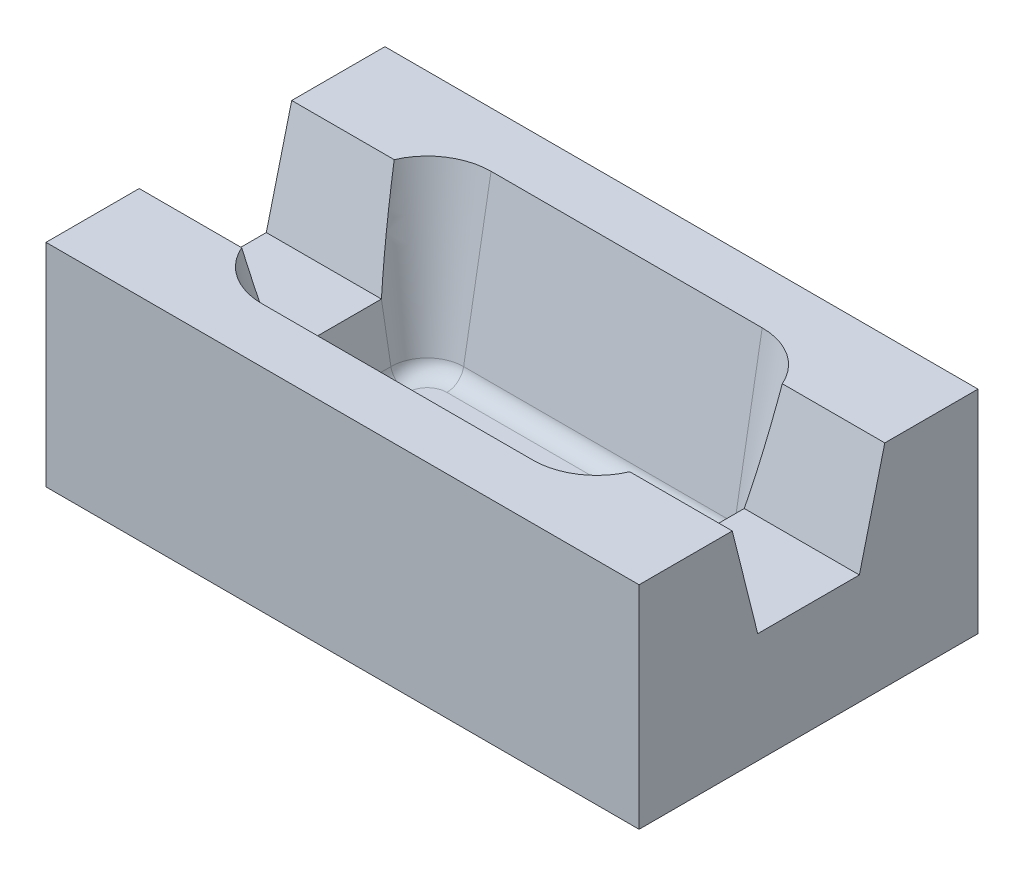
ISO-10303-21;
HEADER;
FILE_DESCRIPTION(('STEP AP214'),'2;1');
FILE_NAME('part.step','',(''),(''),'','','');
FILE_SCHEMA(('AUTOMOTIVE_DESIGN { 1 0 10303 214 1 1 1 1 }'));
ENDSEC;
DATA;
#1=APPLICATION_CONTEXT('core data for automotive mechanical design processes');
#2=APPLICATION_PROTOCOL_DEFINITION('international standard','automotive_design',2000,#1);
#3=PRODUCT_CONTEXT('',#1,'mechanical');
#4=PRODUCT('Part','Part','',(#3));
#5=PRODUCT_RELATED_PRODUCT_CATEGORY('part','',(#4));
#6=PRODUCT_DEFINITION_FORMATION('','',#4);
#7=PRODUCT_DEFINITION_CONTEXT('part definition',#1,'design');
#8=PRODUCT_DEFINITION('design','',#6,#7);
#9=PRODUCT_DEFINITION_SHAPE('','',#8);
#10=(LENGTH_UNIT() NAMED_UNIT(*) SI_UNIT(.MILLI.,.METRE.));
#11=(NAMED_UNIT(*) PLANE_ANGLE_UNIT() SI_UNIT($,.RADIAN.));
#12=(NAMED_UNIT(*) SI_UNIT($,.STERADIAN.) SOLID_ANGLE_UNIT());
#13=UNCERTAINTY_MEASURE_WITH_UNIT(LENGTH_MEASURE(1.E-05),#10,'distance_accuracy_value','');
#14=(GEOMETRIC_REPRESENTATION_CONTEXT(3) GLOBAL_UNCERTAINTY_ASSIGNED_CONTEXT((#13)) GLOBAL_UNIT_ASSIGNED_CONTEXT((#10,
#11,#12)) REPRESENTATION_CONTEXT('',''));
#15=CARTESIAN_POINT('',(0.,0.,0.));
#16=DIRECTION('',(0.,0.,1.));
#17=DIRECTION('',(1.,0.,0.));
#18=AXIS2_PLACEMENT_3D('',#15,#16,#17);
#19=CARTESIAN_POINT('',(-350.,-241.421515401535,59.9999999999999));
#20=DIRECTION('',(0.,0.242535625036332,-0.970142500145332));
#21=DIRECTION('',(0.,0.970142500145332,0.242535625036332));
#22=AXIS2_PLACEMENT_3D('',#19,#20,#21);
#23=PLANE('',#22);
#24=CARTESIAN_POINT('',(-160.,62.3270140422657,135.93713236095));
#25=DIRECTION('',(0.,0.242535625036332,-0.970142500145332));
#26=DIRECTION('',(0.,0.970142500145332,0.242535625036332));
#27=AXIS2_PLACEMENT_3D('',#24,#25,#26);
#28=ELLIPSE('',#27,443.915072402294,76.3239898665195);
#29=CARTESIAN_POINT('',(-214.106158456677,-241.421515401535,59.9999999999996));
#30=VERTEX_POINT('',#29);
#31=CARTESIAN_POINT('',(-229.028109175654,-121.421515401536,89.9999999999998));
#32=VERTEX_POINT('',#31);
#33=EDGE_CURVE('E300',#30,#32,#28,.T.);
#34=ORIENTED_EDGE('',*,*,#33,.F.);
#35=DIRECTION('',(1.,0.,0.));
#36=VECTOR('',#35,1.);
#37=CARTESIAN_POINT('',(-350.,-241.421515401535,59.9999999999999));
#38=LINE('',#37,#36);
#39=CARTESIAN_POINT('',(-350.,-241.421515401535,60.));
#40=VERTEX_POINT('',#39);
#41=EDGE_CURVE('E45',#40,#30,#38,.T.);
#42=ORIENTED_EDGE('',*,*,#41,.F.);
#43=DIRECTION('',(0.,-0.970142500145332,-0.242535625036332));
#44=VECTOR('',#43,1.);
#45=CARTESIAN_POINT('',(-350.,45.6373081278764,131.764705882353));
#46=LINE('',#45,#44);
#47=CARTESIAN_POINT('',(-350.,-121.421515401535,89.9999999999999));
#48=VERTEX_POINT('',#47);
#49=EDGE_CURVE('E205',#48,#40,#46,.T.);
#50=ORIENTED_EDGE('',*,*,#49,.F.);
#51=DIRECTION('',(1.,0.,0.));
#52=VECTOR('',#51,1.);
#53=CARTESIAN_POINT('',(-350.,-121.421515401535,89.9999999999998));
#54=LINE('',#53,#52);
#55=EDGE_CURVE('E211',#48,#32,#54,.T.);
#56=ORIENTED_EDGE('',*,*,#55,.T.);
#57=EDGE_LOOP('',(#34,#42,#50,#56));
#58=FACE_BOUND('',#57,.T.);
#59=ADVANCED_FACE('F36',(#58),#23,.T.);
#60=CARTESIAN_POINT('',(-350.,-121.421515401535,-90.));
#61=DIRECTION('',(0.,0.242535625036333,0.970142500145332));
#62=DIRECTION('',(0.,-0.970142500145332,0.242535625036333));
#63=AXIS2_PLACEMENT_3D('',#60,#61,#62);
#64=PLANE('',#63);
#65=CARTESIAN_POINT('',(-160.,62.3270140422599,-135.937132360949));
#66=DIRECTION('',(0.,0.242535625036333,0.970142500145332));
#67=DIRECTION('',(0.,0.970142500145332,-0.242535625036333));
#68=AXIS2_PLACEMENT_3D('',#65,#66,#67);
#69=ELLIPSE('',#68,443.915072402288,76.323989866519);
#70=CARTESIAN_POINT('',(-229.028109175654,-121.421515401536,-90.));
#71=VERTEX_POINT('',#70);
#72=CARTESIAN_POINT('',(-214.106158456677,-241.421515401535,-59.9999999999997));
#73=VERTEX_POINT('',#72);
#74=EDGE_CURVE('E210',#71,#73,#69,.T.);
#75=ORIENTED_EDGE('',*,*,#74,.F.);
#76=DIRECTION('',(-1.,0.,0.));
#77=VECTOR('',#76,1.);
#78=CARTESIAN_POINT('',(-160.,-121.421515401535,-90.));
#79=LINE('',#78,#77);
#80=CARTESIAN_POINT('',(-350.,-121.421515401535,-90.));
#81=VERTEX_POINT('',#80);
#82=EDGE_CURVE('E192',#71,#81,#79,.T.);
#83=ORIENTED_EDGE('',*,*,#82,.T.);
#84=DIRECTION('',(0.,0.970142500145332,-0.242535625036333));
#85=VECTOR('',#84,1.);
#86=CARTESIAN_POINT('',(-350.,-48.4803389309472,-108.235294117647));
#87=LINE('',#86,#85);
#88=CARTESIAN_POINT('',(-350.,-241.421515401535,-60.));
#89=VERTEX_POINT('',#88);
#90=EDGE_CURVE('E200',#89,#81,#87,.T.);
#91=ORIENTED_EDGE('',*,*,#90,.F.);
#92=DIRECTION('',(1.,0.,0.));
#93=VECTOR('',#92,1.);
#94=CARTESIAN_POINT('',(-350.,-241.421515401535,-60.));
#95=LINE('',#94,#93);
#96=EDGE_CURVE('E11',#89,#73,#95,.T.);
#97=ORIENTED_EDGE('',*,*,#96,.T.);
#98=EDGE_LOOP('',(#75,#83,#91,#97));
#99=FACE_BOUND('',#98,.T.);
#100=ADVANCED_FACE('F208',(#99),#64,.T.);
#101=CARTESIAN_POINT('',(-350.,-241.421515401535,-60.));
#102=DIRECTION('',(0.,1.,0.));
#103=DIRECTION('',(0.,0.,1.));
#104=AXIS2_PLACEMENT_3D('',#101,#102,#103);
#105=PLANE('',#104);
#106=DIRECTION('',(0.,0.,-1.));
#107=VECTOR('',#106,1.);
#108=CARTESIAN_POINT('',(-214.106158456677,-241.421515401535,-59.9999999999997));
#109=LINE('',#108,#107);
#110=EDGE_CURVE('E214',#73,#30,#109,.F.);
#111=ORIENTED_EDGE('',*,*,#110,.F.);
#112=ORIENTED_EDGE('',*,*,#96,.F.);
#113=DIRECTION('',(0.,0.,-1.));
#114=VECTOR('',#113,1.);
#115=CARTESIAN_POINT('',(-350.,-241.421515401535,200.));
#116=LINE('',#115,#114);
#117=EDGE_CURVE('E203',#40,#89,#116,.T.);
#118=ORIENTED_EDGE('',*,*,#117,.F.);
#119=ORIENTED_EDGE('',*,*,#41,.T.);
#120=EDGE_LOOP('',(#111,#112,#118,#119));
#121=FACE_BOUND('',#120,.T.);
#122=ADVANCED_FACE('F470',(#121),#105,.T.);
#123=CARTESIAN_POINT('',(183.218007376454,-301.421515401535,-59.9999999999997));
#124=DIRECTION('',(0.,0.,-1.));
#125=DIRECTION('',(-1.,0.,0.));
#126=AXIS2_PLACEMENT_3D('',#123,#124,#125);
#127=CYLINDRICAL_SURFACE('',#126,20.);
#128=CARTESIAN_POINT('',(183.218007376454,-301.421515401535,59.9999999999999));
#129=DIRECTION('',(0.,0.,-1.));
#130=DIRECTION('',(-1.,0.,0.));
#131=AXIS2_PLACEMENT_3D('',#128,#129,#130);
#132=CIRCLE('',#131,20.);
#133=CARTESIAN_POINT('',(202.914162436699,-304.894478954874,59.9999999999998));
#134=VERTEX_POINT('',#133);
#135=CARTESIAN_POINT('',(183.218007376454,-321.421515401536,59.9999999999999));
#136=VERTEX_POINT('',#135);
#137=EDGE_CURVE('E408',#134,#136,#132,.T.);
#138=ORIENTED_EDGE('',*,*,#137,.F.);
#139=DIRECTION('',(0.,0.,-1.));
#140=VECTOR('',#139,1.);
#141=CARTESIAN_POINT('',(202.914162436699,-304.894478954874,-59.9999999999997));
#142=LINE('',#141,#140);
#143=CARTESIAN_POINT('',(202.914162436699,-304.894478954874,-59.9999999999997));
#144=VERTEX_POINT('',#143);
#145=EDGE_CURVE('E402',#134,#144,#142,.T.);
#146=ORIENTED_EDGE('',*,*,#145,.T.);
#147=CARTESIAN_POINT('',(183.218007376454,-301.421515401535,-59.9999999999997));
#148=DIRECTION('',(0.,0.,-1.));
#149=DIRECTION('',(-1.,0.,0.));
#150=AXIS2_PLACEMENT_3D('',#147,#148,#149);
#151=CIRCLE('',#150,20.);
#152=CARTESIAN_POINT('',(183.218007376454,-321.421515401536,-59.9999999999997));
#153=VERTEX_POINT('',#152);
#154=EDGE_CURVE('E400',#144,#153,#151,.T.);
#155=ORIENTED_EDGE('',*,*,#154,.T.);
#156=DIRECTION('',(0.,0.,1.));
#157=VECTOR('',#156,1.);
#158=CARTESIAN_POINT('',(183.218007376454,-321.421515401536,59.9999999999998));
#159=LINE('',#158,#157);
#160=EDGE_CURVE('E397',#153,#136,#159,.T.);
#161=ORIENTED_EDGE('',*,*,#160,.T.);
#162=EDGE_LOOP('',(#138,#146,#155,#161));
#163=FACE_BOUND('',#162,.T.);
#164=ADVANCED_FACE('F446',(#163),#127,.F.);
#165=CARTESIAN_POINT('',(160.,-321.421515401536,-60.));
#166=DIRECTION('',(0.,-1.,0.));
#167=DIRECTION('',(0.,0.,-1.));
#168=AXIS2_PLACEMENT_3D('',#165,#166,#167);
#169=PLANE('',#168);
#170=CARTESIAN_POINT('',(-160.,-321.421515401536,-60.));
#171=DIRECTION('',(0.,-1.,0.));
#172=DIRECTION('',(0.,0.,-1.));
#173=AXIS2_PLACEMENT_3D('',#170,#171,#172);
#174=CIRCLE('',#173,23.2180073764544);
#175=CARTESIAN_POINT('',(-183.218007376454,-321.421515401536,-59.9999999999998));
#176=VERTEX_POINT('',#175);
#177=CARTESIAN_POINT('',(-160.,-321.421515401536,-83.2180073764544));
#178=VERTEX_POINT('',#177);
#179=EDGE_CURVE('E262',#176,#178,#174,.T.);
#180=ORIENTED_EDGE('',*,*,#179,.F.);
#181=DIRECTION('',(0.,0.,-1.));
#182=VECTOR('',#181,1.);
#183=CARTESIAN_POINT('',(-183.218007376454,-321.421515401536,-59.9999999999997));
#184=LINE('',#183,#182);
#185=CARTESIAN_POINT('',(-183.218007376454,-321.421515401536,59.9999999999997));
#186=VERTEX_POINT('',#185);
#187=EDGE_CURVE('E271',#186,#176,#184,.T.);
#188=ORIENTED_EDGE('',*,*,#187,.F.);
#189=CARTESIAN_POINT('',(-160.,-321.421515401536,60.));
#190=DIRECTION('',(0.,-1.,0.));
#191=DIRECTION('',(0.,0.,-1.));
#192=AXIS2_PLACEMENT_3D('',#189,#190,#191);
#193=CIRCLE('',#192,23.2180073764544);
#194=CARTESIAN_POINT('',(-160.,-321.421515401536,83.2180073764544));
#195=VERTEX_POINT('',#194);
#196=EDGE_CURVE('E236',#195,#186,#193,.T.);
#197=ORIENTED_EDGE('',*,*,#196,.F.);
#198=DIRECTION('',(-1.,0.,0.));
#199=VECTOR('',#198,1.);
#200=CARTESIAN_POINT('',(-160.,-321.421515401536,83.2180073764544));
#201=LINE('',#200,#199);
#202=CARTESIAN_POINT('',(160.,-321.421515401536,83.2180073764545));
#203=VERTEX_POINT('',#202);
#204=EDGE_CURVE('E413',#203,#195,#201,.T.);
#205=ORIENTED_EDGE('',*,*,#204,.F.);
#206=CARTESIAN_POINT('',(160.,-321.421515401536,60.));
#207=DIRECTION('',(0.,-1.,0.));
#208=DIRECTION('',(0.,0.,-1.));
#209=AXIS2_PLACEMENT_3D('',#206,#207,#208);
#210=CIRCLE('',#209,23.2180073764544);
#211=EDGE_CURVE('E405',#136,#203,#210,.T.);
#212=ORIENTED_EDGE('',*,*,#211,.F.);
#213=ORIENTED_EDGE('',*,*,#160,.F.);
#214=CARTESIAN_POINT('',(160.,-321.421515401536,-60.));
#215=DIRECTION('',(0.,-1.,0.));
#216=DIRECTION('',(0.,0.,-1.));
#217=AXIS2_PLACEMENT_3D('',#214,#215,#216);
#218=CIRCLE('',#217,23.2180073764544);
#219=CARTESIAN_POINT('',(160.,-321.421515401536,-83.2180073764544));
#220=VERTEX_POINT('',#219);
#221=EDGE_CURVE('E350',#220,#153,#218,.T.);
#222=ORIENTED_EDGE('',*,*,#221,.F.);
#223=DIRECTION('',(1.,0.,0.));
#224=VECTOR('',#223,1.);
#225=CARTESIAN_POINT('',(160.,-321.421515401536,-83.2180073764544));
#226=LINE('',#225,#224);
#227=EDGE_CURVE('E250',#178,#220,#226,.T.);
#228=ORIENTED_EDGE('',*,*,#227,.F.);
#229=EDGE_LOOP('',(#180,#188,#197,#205,#212,#213,#222,#228));
#230=FACE_BOUND('',#229,.T.);
#231=ADVANCED_FACE('F441',(#230),#169,.F.);
#232=CARTESIAN_POINT('',(-160.,-301.421515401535,83.2180073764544));
#233=DIRECTION('',(1.,0.,0.));
#234=DIRECTION('',(0.,0.,-1.));
#235=AXIS2_PLACEMENT_3D('',#232,#233,#234);
#236=CYLINDRICAL_SURFACE('',#235,20.);
#237=CARTESIAN_POINT('',(-160.,-301.421515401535,83.2180073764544));
#238=DIRECTION('',(-1.,0.,0.));
#239=DIRECTION('',(0.,0.,1.));
#240=AXIS2_PLACEMENT_3D('',#237,#238,#239);
#241=CIRCLE('',#240,20.);
#242=CARTESIAN_POINT('',(-160.,-304.894478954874,102.914162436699));
#243=VERTEX_POINT('',#242);
#244=EDGE_CURVE('E316',#195,#243,#241,.T.);
#245=ORIENTED_EDGE('',*,*,#244,.T.);
#246=DIRECTION('',(1.,0.,0.));
#247=VECTOR('',#246,1.);
#248=CARTESIAN_POINT('',(160.,-304.894478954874,102.914162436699));
#249=LINE('',#248,#247);
#250=CARTESIAN_POINT('',(160.,-304.894478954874,102.914162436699));
#251=VERTEX_POINT('',#250);
#252=EDGE_CURVE('E418',#243,#251,#249,.T.);
#253=ORIENTED_EDGE('',*,*,#252,.T.);
#254=CARTESIAN_POINT('',(160.,-301.421515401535,83.2180073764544));
#255=DIRECTION('',(1.,0.,0.));
#256=DIRECTION('',(0.,0.,-1.));
#257=AXIS2_PLACEMENT_3D('',#254,#255,#256);
#258=CIRCLE('',#257,20.);
#259=EDGE_CURVE('E416',#251,#203,#258,.T.);
#260=ORIENTED_EDGE('',*,*,#259,.T.);
#261=ORIENTED_EDGE('',*,*,#204,.T.);
#262=EDGE_LOOP('',(#245,#253,#260,#261));
#263=FACE_BOUND('',#262,.T.);
#264=ADVANCED_FACE('F423',(#263),#236,.F.);
#265=CARTESIAN_POINT('',(160.,-301.421515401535,60.));
#266=DIRECTION('',(0.,-1.,0.));
#267=DIRECTION('',(0.,0.,-1.));
#268=AXIS2_PLACEMENT_3D('',#265,#266,#267);
#269=TOROIDAL_SURFACE('',#268,23.2180073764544,20.);
#270=ORIENTED_EDGE('',*,*,#259,.F.);
#271=CARTESIAN_POINT('',(160.,-304.894478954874,60.));
#272=DIRECTION('',(0.,1.,0.));
#273=DIRECTION('',(0.,0.,1.));
#274=AXIS2_PLACEMENT_3D('',#271,#272,#273);
#275=CIRCLE('',#274,42.9141624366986);
#276=EDGE_CURVE('E410',#251,#134,#275,.T.);
#277=ORIENTED_EDGE('',*,*,#276,.T.);
#278=ORIENTED_EDGE('',*,*,#137,.T.);
#279=ORIENTED_EDGE('',*,*,#211,.T.);
#280=EDGE_LOOP('',(#270,#277,#278,#279));
#281=FACE_BOUND('',#280,.T.);
#282=ADVANCED_FACE('F436',(#281),#269,.F.);
#283=CARTESIAN_POINT('',(350.,-241.421515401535,-59.9999999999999));
#284=DIRECTION('',(0.,1.,0.));
#285=DIRECTION('',(0.,0.,1.));
#286=AXIS2_PLACEMENT_3D('',#283,#284,#285);
#287=PLANE('',#286);
#288=DIRECTION('',(0.,0.,1.));
#289=VECTOR('',#288,1.);
#290=CARTESIAN_POINT('',(350.,-241.421515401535,200.));
#291=LINE('',#290,#289);
#292=CARTESIAN_POINT('',(350.,-241.421515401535,-60.0000000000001));
#293=VERTEX_POINT('',#292);
#294=CARTESIAN_POINT('',(350.,-241.421515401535,60.));
#295=VERTEX_POINT('',#294);
#296=EDGE_CURVE('E367',#293,#295,#291,.T.);
#297=ORIENTED_EDGE('',*,*,#296,.F.);
#298=DIRECTION('',(-1.,0.,0.));
#299=VECTOR('',#298,1.);
#300=CARTESIAN_POINT('',(350.,-241.421515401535,-59.9999999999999));
#301=LINE('',#300,#299);
#302=CARTESIAN_POINT('',(214.106158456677,-241.421515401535,-59.9999999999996));
#303=VERTEX_POINT('',#302);
#304=EDGE_CURVE('E293',#293,#303,#301,.T.);
#305=ORIENTED_EDGE('',*,*,#304,.T.);
#306=DIRECTION('',(0.,0.,1.));
#307=VECTOR('',#306,1.);
#308=CARTESIAN_POINT('',(214.106158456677,-241.421515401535,-59.9999999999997));
#309=LINE('',#308,#307);
#310=CARTESIAN_POINT('',(214.106158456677,-241.421515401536,59.9999999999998));
#311=VERTEX_POINT('',#310);
#312=EDGE_CURVE('E360',#311,#303,#309,.F.);
#313=ORIENTED_EDGE('',*,*,#312,.F.);
#314=DIRECTION('',(-1.,0.,0.));
#315=VECTOR('',#314,1.);
#316=CARTESIAN_POINT('',(350.,-241.421515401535,60.));
#317=LINE('',#316,#315);
#318=EDGE_CURVE('E297',#295,#311,#317,.T.);
#319=ORIENTED_EDGE('',*,*,#318,.F.);
#320=EDGE_LOOP('',(#297,#305,#313,#319));
#321=FACE_BOUND('',#320,.T.);
#322=ADVANCED_FACE('F505',(#321),#287,.T.);
#323=CARTESIAN_POINT('',(160.,-301.421515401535,-60.));
#324=DIRECTION('',(0.,-1.,0.));
#325=DIRECTION('',(0.,0.,-1.));
#326=AXIS2_PLACEMENT_3D('',#323,#324,#325);
#327=TOROIDAL_SURFACE('',#326,23.2180073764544,20.);
#328=ORIENTED_EDGE('',*,*,#154,.F.);
#329=CARTESIAN_POINT('',(160.,-304.894478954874,-60.));
#330=DIRECTION('',(0.,1.,0.));
#331=DIRECTION('',(0.,0.,1.));
#332=AXIS2_PLACEMENT_3D('',#329,#330,#331);
#333=CIRCLE('',#332,42.9141624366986);
#334=CARTESIAN_POINT('',(160.,-304.894478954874,-102.914162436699));
#335=VERTEX_POINT('',#334);
#336=EDGE_CURVE('E395',#144,#335,#333,.T.);
#337=ORIENTED_EDGE('',*,*,#336,.T.);
#338=CARTESIAN_POINT('',(160.,-301.421515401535,-83.2180073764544));
#339=DIRECTION('',(-1.,0.,0.));
#340=DIRECTION('',(0.,-1.,0.));
#341=AXIS2_PLACEMENT_3D('',#338,#339,#340);
#342=CIRCLE('',#341,20.);
#343=EDGE_CURVE('E336',#335,#220,#342,.T.);
#344=ORIENTED_EDGE('',*,*,#343,.T.);
#345=ORIENTED_EDGE('',*,*,#221,.T.);
#346=EDGE_LOOP('',(#328,#337,#344,#345));
#347=FACE_BOUND('',#346,.T.);
#348=ADVANCED_FACE('F444',(#347),#327,.F.);
#349=CARTESIAN_POINT('',(200.,-321.421515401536,-59.9999999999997));
#350=DIRECTION('',(0.984807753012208,-0.173648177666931,0.));
#351=DIRECTION('',(0.173648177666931,0.984807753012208,0.));
#352=AXIS2_PLACEMENT_3D('',#349,#350,#351);
#353=PLANE('',#352);
#354=DIRECTION('',(0.173648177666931,0.984807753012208,0.));
#355=VECTOR('',#354,1.);
#356=CARTESIAN_POINT('',(200.,-321.421515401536,59.9999999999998));
#357=LINE('',#356,#355);
#358=EDGE_CURVE('E433',#311,#134,#357,.F.);
#359=ORIENTED_EDGE('',*,*,#358,.F.);
#360=ORIENTED_EDGE('',*,*,#312,.T.);
#361=DIRECTION('',(0.173648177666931,0.984807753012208,0.));
#362=VECTOR('',#361,1.);
#363=CARTESIAN_POINT('',(200.,-321.421515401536,-59.9999999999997));
#364=LINE('',#363,#362);
#365=EDGE_CURVE('E357',#303,#144,#364,.F.);
#366=ORIENTED_EDGE('',*,*,#365,.T.);
#367=ORIENTED_EDGE('',*,*,#145,.F.);
#368=EDGE_LOOP('',(#359,#360,#366,#367));
#369=FACE_BOUND('',#368,.T.);
#370=ADVANCED_FACE('F448',(#369),#353,.F.);
#371=CARTESIAN_POINT('',(-160.,-301.421515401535,-83.2180073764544));
#372=DIRECTION('',(-1.,0.,0.));
#373=DIRECTION('',(0.,0.,1.));
#374=AXIS2_PLACEMENT_3D('',#371,#372,#373);
#375=CYLINDRICAL_SURFACE('',#374,20.);
#376=ORIENTED_EDGE('',*,*,#343,.F.);
#377=DIRECTION('',(-1.,0.,0.));
#378=VECTOR('',#377,1.);
#379=CARTESIAN_POINT('',(-160.,-304.894478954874,-102.914162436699));
#380=LINE('',#379,#378);
#381=CARTESIAN_POINT('',(-160.,-304.894478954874,-102.914162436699));
#382=VERTEX_POINT('',#381);
#383=EDGE_CURVE('E253',#335,#382,#380,.T.);
#384=ORIENTED_EDGE('',*,*,#383,.T.);
#385=CARTESIAN_POINT('',(-160.,-301.421515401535,-83.2180073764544));
#386=DIRECTION('',(1.,0.,0.));
#387=DIRECTION('',(0.,0.,-1.));
#388=AXIS2_PLACEMENT_3D('',#385,#386,#387);
#389=CIRCLE('',#388,20.);
#390=EDGE_CURVE('E259',#178,#382,#389,.T.);
#391=ORIENTED_EDGE('',*,*,#390,.F.);
#392=ORIENTED_EDGE('',*,*,#227,.T.);
#393=EDGE_LOOP('',(#376,#384,#391,#392));
#394=FACE_BOUND('',#393,.T.);
#395=ADVANCED_FACE('F334',(#394),#375,.F.);
#396=CARTESIAN_POINT('',(-183.218007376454,-301.421515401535,-59.9999999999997));
#397=DIRECTION('',(0.,0.,1.));
#398=DIRECTION('',(1.,0.,0.));
#399=AXIS2_PLACEMENT_3D('',#396,#397,#398);
#400=CYLINDRICAL_SURFACE('',#399,20.);
#401=CARTESIAN_POINT('',(-183.218007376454,-301.421515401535,59.9999999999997));
#402=DIRECTION('',(0.,0.,-1.));
#403=DIRECTION('',(-1.,0.,0.));
#404=AXIS2_PLACEMENT_3D('',#401,#402,#403);
#405=CIRCLE('',#404,20.);
#406=CARTESIAN_POINT('',(-202.914162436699,-304.894478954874,59.9999999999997));
#407=VERTEX_POINT('',#406);
#408=EDGE_CURVE('E241',#186,#407,#405,.T.);
#409=ORIENTED_EDGE('',*,*,#408,.F.);
#410=ORIENTED_EDGE('',*,*,#187,.T.);
#411=CARTESIAN_POINT('',(-183.218007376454,-301.421515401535,-59.9999999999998));
#412=DIRECTION('',(0.,0.,-1.));
#413=DIRECTION('',(-1.,0.,0.));
#414=AXIS2_PLACEMENT_3D('',#411,#412,#413);
#415=CIRCLE('',#414,20.);
#416=CARTESIAN_POINT('',(-202.914162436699,-304.894478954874,-59.9999999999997));
#417=VERTEX_POINT('',#416);
#418=EDGE_CURVE('E268',#176,#417,#415,.T.);
#419=ORIENTED_EDGE('',*,*,#418,.T.);
#420=DIRECTION('',(0.,0.,1.));
#421=VECTOR('',#420,1.);
#422=CARTESIAN_POINT('',(-202.914162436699,-304.894478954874,59.9999999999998));
#423=LINE('',#422,#421);
#424=EDGE_CURVE('E265',#417,#407,#423,.T.);
#425=ORIENTED_EDGE('',*,*,#424,.T.);
#426=EDGE_LOOP('',(#409,#410,#419,#425));
#427=FACE_BOUND('',#426,.T.);
#428=ADVANCED_FACE('F322',(#427),#400,.F.);
#429=CARTESIAN_POINT('',(-160.,-301.421515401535,-60.));
#430=DIRECTION('',(0.,-1.,0.));
#431=DIRECTION('',(0.,0.,-1.));
#432=AXIS2_PLACEMENT_3D('',#429,#430,#431);
#433=TOROIDAL_SURFACE('',#432,23.2180073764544,20.);
#434=ORIENTED_EDGE('',*,*,#418,.F.);
#435=ORIENTED_EDGE('',*,*,#179,.T.);
#436=ORIENTED_EDGE('',*,*,#390,.T.);
#437=CARTESIAN_POINT('',(-160.,-304.894478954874,-60.));
#438=DIRECTION('',(0.,1.,0.));
#439=DIRECTION('',(0.,0.,1.));
#440=AXIS2_PLACEMENT_3D('',#437,#438,#439);
#441=CIRCLE('',#440,42.9141624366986);
#442=EDGE_CURVE('E256',#382,#417,#441,.T.);
#443=ORIENTED_EDGE('',*,*,#442,.T.);
#444=EDGE_LOOP('',(#434,#435,#436,#443));
#445=FACE_BOUND('',#444,.T.);
#446=ADVANCED_FACE('F326',(#445),#433,.F.);
#447=CARTESIAN_POINT('',(-160.,-301.421515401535,60.));
#448=DIRECTION('',(0.,-1.,0.));
#449=DIRECTION('',(0.,0.,-1.));
#450=AXIS2_PLACEMENT_3D('',#447,#448,#449);
#451=TOROIDAL_SURFACE('',#450,23.2180073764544,20.);
#452=ORIENTED_EDGE('',*,*,#244,.F.);
#453=ORIENTED_EDGE('',*,*,#196,.T.);
#454=ORIENTED_EDGE('',*,*,#408,.T.);
#455=CARTESIAN_POINT('',(-160.,-304.894478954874,60.));
#456=DIRECTION('',(0.,1.,0.));
#457=DIRECTION('',(0.,0.,1.));
#458=AXIS2_PLACEMENT_3D('',#455,#456,#457);
#459=CIRCLE('',#458,42.9141624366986);
#460=EDGE_CURVE('E313',#407,#243,#459,.T.);
#461=ORIENTED_EDGE('',*,*,#460,.T.);
#462=EDGE_LOOP('',(#452,#453,#454,#461));
#463=FACE_BOUND('',#462,.T.);
#464=ADVANCED_FACE('F318',(#463),#451,.F.);
#465=CARTESIAN_POINT('',(-200.,-321.421515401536,-59.9999999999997));
#466=DIRECTION('',(-0.984807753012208,-0.173648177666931,0.));
#467=DIRECTION('',(0.173648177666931,-0.984807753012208,0.));
#468=AXIS2_PLACEMENT_3D('',#465,#466,#467);
#469=PLANE('',#468);
#470=DIRECTION('',(-0.173648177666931,0.984807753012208,0.));
#471=VECTOR('',#470,1.);
#472=CARTESIAN_POINT('',(-200.,-321.421515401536,-59.9999999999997));
#473=LINE('',#472,#471);
#474=EDGE_CURVE('E218',#73,#417,#473,.F.);
#475=ORIENTED_EDGE('',*,*,#474,.F.);
#476=ORIENTED_EDGE('',*,*,#110,.T.);
#477=DIRECTION('',(-0.173648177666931,0.984807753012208,0.));
#478=VECTOR('',#477,1.);
#479=CARTESIAN_POINT('',(-200.,-321.421515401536,59.9999999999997));
#480=LINE('',#479,#478);
#481=EDGE_CURVE('E224',#30,#407,#480,.F.);
#482=ORIENTED_EDGE('',*,*,#481,.T.);
#483=ORIENTED_EDGE('',*,*,#424,.F.);
#484=EDGE_LOOP('',(#475,#476,#482,#483));
#485=FACE_BOUND('',#484,.T.);
#486=ADVANCED_FACE('F307',(#485),#469,.F.);
#487=CARTESIAN_POINT('',(0.,-371.421515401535,0.));
#488=DIRECTION('',(0.,-1.,0.));
#489=DIRECTION('',(0.,0.,-1.));
#490=AXIS2_PLACEMENT_3D('',#487,#488,#489);
#491=PLANE('',#490);
#492=DIRECTION('',(0.,0.,1.));
#493=VECTOR('',#492,1.);
#494=CARTESIAN_POINT('',(350.,-371.421515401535,200.));
#495=LINE('',#494,#493);
#496=CARTESIAN_POINT('',(350.,-371.421515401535,-200.));
#497=VERTEX_POINT('',#496);
#498=CARTESIAN_POINT('',(350.,-371.421515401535,200.));
#499=VERTEX_POINT('',#498);
#500=EDGE_CURVE('E292',#497,#499,#495,.T.);
#501=ORIENTED_EDGE('',*,*,#500,.T.);
#502=DIRECTION('',(-1.,0.,0.));
#503=VECTOR('',#502,1.);
#504=CARTESIAN_POINT('',(-350.,-371.421515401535,200.));
#505=LINE('',#504,#503);
#506=CARTESIAN_POINT('',(-350.,-371.421515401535,200.));
#507=VERTEX_POINT('',#506);
#508=EDGE_CURVE('E386',#499,#507,#505,.T.);
#509=ORIENTED_EDGE('',*,*,#508,.T.);
#510=DIRECTION('',(0.,0.,-1.));
#511=VECTOR('',#510,1.);
#512=CARTESIAN_POINT('',(-350.,-371.421515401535,200.));
#513=LINE('',#512,#511);
#514=CARTESIAN_POINT('',(-350.,-371.421515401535,-200.));
#515=VERTEX_POINT('',#514);
#516=EDGE_CURVE('E383',#507,#515,#513,.T.);
#517=ORIENTED_EDGE('',*,*,#516,.T.);
#518=DIRECTION('',(1.,0.,0.));
#519=VECTOR('',#518,1.);
#520=CARTESIAN_POINT('',(-350.,-371.421515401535,-200.));
#521=LINE('',#520,#519);
#522=EDGE_CURVE('E280',#515,#497,#521,.T.);
#523=ORIENTED_EDGE('',*,*,#522,.T.);
#524=EDGE_LOOP('',(#501,#509,#517,#523));
#525=FACE_BOUND('',#524,.T.);
#526=ADVANCED_FACE('F460',(#525),#491,.T.);
#527=CARTESIAN_POINT('',(-160.,-321.421515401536,60.));
#528=DIRECTION('',(0.,1.,0.));
#529=DIRECTION('',(0.,0.,1.));
#530=AXIS2_PLACEMENT_3D('',#527,#528,#529);
#531=CONICAL_SURFACE('',#530,40.,0.174532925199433);
#532=ORIENTED_EDGE('',*,*,#481,.F.);
#533=ORIENTED_EDGE('',*,*,#33,.T.);
#534=CARTESIAN_POINT('',(-160.,-121.421515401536,60.));
#535=DIRECTION('',(0.,1.,0.));
#536=DIRECTION('',(0.,0.,1.));
#537=AXIS2_PLACEMENT_3D('',#534,#535,#536);
#538=CIRCLE('',#537,75.2653961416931);
#539=CARTESIAN_POINT('',(-160.,-121.421515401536,135.265396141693));
#540=VERTEX_POINT('',#539);
#541=EDGE_CURVE('E225',#32,#540,#538,.T.);
#542=ORIENTED_EDGE('',*,*,#541,.T.);
#543=DIRECTION('',(0.,0.984807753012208,0.173648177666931));
#544=VECTOR('',#543,1.);
#545=CARTESIAN_POINT('',(-160.,-321.421515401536,100.));
#546=LINE('',#545,#544);
#547=EDGE_CURVE('E227',#540,#243,#546,.F.);
#548=ORIENTED_EDGE('',*,*,#547,.T.);
#549=ORIENTED_EDGE('',*,*,#460,.F.);
#550=EDGE_LOOP('',(#532,#533,#542,#548,#549));
#551=FACE_BOUND('',#550,.T.);
#552=ADVANCED_FACE('F310',(#551),#531,.F.);
#553=CARTESIAN_POINT('',(-160.,-321.421515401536,100.));
#554=DIRECTION('',(0.,-0.173648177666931,0.984807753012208));
#555=DIRECTION('',(0.,-0.984807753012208,-0.173648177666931));
#556=AXIS2_PLACEMENT_3D('',#553,#554,#555);
#557=PLANE('',#556);
#558=ORIENTED_EDGE('',*,*,#547,.F.);
#559=DIRECTION('',(-1.,0.,0.));
#560=VECTOR('',#559,1.);
#561=CARTESIAN_POINT('',(160.,-121.421515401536,135.265396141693));
#562=LINE('',#561,#560);
#563=CARTESIAN_POINT('',(160.,-121.421515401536,135.265396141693));
#564=VERTEX_POINT('',#563);
#565=EDGE_CURVE('E276',#540,#564,#562,.F.);
#566=ORIENTED_EDGE('',*,*,#565,.T.);
#567=DIRECTION('',(0.,0.984807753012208,0.173648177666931));
#568=VECTOR('',#567,1.);
#569=CARTESIAN_POINT('',(160.,-321.421515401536,100.));
#570=LINE('',#569,#568);
#571=EDGE_CURVE('E274',#564,#251,#570,.F.);
#572=ORIENTED_EDGE('',*,*,#571,.T.);
#573=ORIENTED_EDGE('',*,*,#252,.F.);
#574=EDGE_LOOP('',(#558,#566,#572,#573));
#575=FACE_BOUND('',#574,.T.);
#576=ADVANCED_FACE('F426',(#575),#557,.F.);
#577=CARTESIAN_POINT('',(160.,-321.421515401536,60.));
#578=DIRECTION('',(0.,1.,0.));
#579=DIRECTION('',(0.,0.,1.));
#580=AXIS2_PLACEMENT_3D('',#577,#578,#579);
#581=CONICAL_SURFACE('',#580,40.,0.174532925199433);
#582=CARTESIAN_POINT('',(160.,-121.421515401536,60.));
#583=DIRECTION('',(0.,1.,0.));
#584=DIRECTION('',(0.,0.,1.));
#585=AXIS2_PLACEMENT_3D('',#582,#583,#584);
#586=CIRCLE('',#585,75.2653961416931);
#587=CARTESIAN_POINT('',(229.028109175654,-121.421515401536,89.9999999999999));
#588=VERTEX_POINT('',#587);
#589=EDGE_CURVE('E284',#564,#588,#586,.T.);
#590=ORIENTED_EDGE('',*,*,#589,.T.);
#591=CARTESIAN_POINT('',(160.,62.3270140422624,135.937132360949));
#592=DIRECTION('',(0.,0.242535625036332,-0.970142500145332));
#593=DIRECTION('',(0.,0.970142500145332,0.242535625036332));
#594=AXIS2_PLACEMENT_3D('',#591,#592,#593);
#595=ELLIPSE('',#594,443.915072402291,76.3239898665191);
#596=EDGE_CURVE('E376',#588,#311,#595,.T.);
#597=ORIENTED_EDGE('',*,*,#596,.T.);
#598=ORIENTED_EDGE('',*,*,#358,.T.);
#599=ORIENTED_EDGE('',*,*,#276,.F.);
#600=ORIENTED_EDGE('',*,*,#571,.F.);
#601=EDGE_LOOP('',(#590,#597,#598,#599,#600));
#602=FACE_BOUND('',#601,.T.);
#603=ADVANCED_FACE('F431',(#602),#581,.F.);
#604=CARTESIAN_POINT('',(350.,-121.421515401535,89.9999999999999));
#605=DIRECTION('',(0.,0.242535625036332,-0.970142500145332));
#606=DIRECTION('',(0.,0.970142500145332,0.242535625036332));
#607=AXIS2_PLACEMENT_3D('',#604,#605,#606);
#608=PLANE('',#607);
#609=DIRECTION('',(0.,0.970142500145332,0.242535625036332));
#610=VECTOR('',#609,1.);
#611=CARTESIAN_POINT('',(350.,45.6373081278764,131.764705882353));
#612=LINE('',#611,#610);
#613=CARTESIAN_POINT('',(350.,-121.421515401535,89.9999999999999));
#614=VERTEX_POINT('',#613);
#615=EDGE_CURVE('E359',#295,#614,#612,.T.);
#616=ORIENTED_EDGE('',*,*,#615,.F.);
#617=ORIENTED_EDGE('',*,*,#318,.T.);
#618=ORIENTED_EDGE('',*,*,#596,.F.);
#619=DIRECTION('',(1.,0.,0.));
#620=VECTOR('',#619,1.);
#621=CARTESIAN_POINT('',(-160.,-121.421515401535,89.9999999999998));
#622=LINE('',#621,#620);
#623=EDGE_CURVE('E296',#588,#614,#622,.T.);
#624=ORIENTED_EDGE('',*,*,#623,.T.);
#625=EDGE_LOOP('',(#616,#617,#618,#624));
#626=FACE_BOUND('',#625,.T.);
#627=ADVANCED_FACE('F655',(#626),#608,.T.);
#628=CARTESIAN_POINT('',(-350.,28.5784845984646,200.));
#629=DIRECTION('',(0.,0.,1.));
#630=DIRECTION('',(1.,0.,0.));
#631=AXIS2_PLACEMENT_3D('',#628,#629,#630);
#632=PLANE('',#631);
#633=DIRECTION('',(1.,0.,0.));
#634=VECTOR('',#633,1.);
#635=CARTESIAN_POINT('',(-350.,-121.421515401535,200.));
#636=LINE('',#635,#634);
#637=CARTESIAN_POINT('',(-350.,-121.421515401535,200.));
#638=VERTEX_POINT('',#637);
#639=CARTESIAN_POINT('',(350.,-121.421515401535,200.));
#640=VERTEX_POINT('',#639);
#641=EDGE_CURVE('E282',#638,#640,#636,.T.);
#642=ORIENTED_EDGE('',*,*,#641,.F.);
#643=DIRECTION('',(0.,-1.,0.));
#644=VECTOR('',#643,1.);
#645=CARTESIAN_POINT('',(-350.,28.5784845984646,200.));
#646=LINE('',#645,#644);
#647=EDGE_CURVE('E290',#638,#507,#646,.T.);
#648=ORIENTED_EDGE('',*,*,#647,.T.);
#649=ORIENTED_EDGE('',*,*,#508,.F.);
#650=DIRECTION('',(0.,-1.,0.));
#651=VECTOR('',#650,1.);
#652=CARTESIAN_POINT('',(350.,28.5784845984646,200.));
#653=LINE('',#652,#651);
#654=EDGE_CURVE('E288',#640,#499,#653,.T.);
#655=ORIENTED_EDGE('',*,*,#654,.F.);
#656=EDGE_LOOP('',(#642,#648,#649,#655));
#657=FACE_BOUND('',#656,.T.);
#658=ADVANCED_FACE('F466',(#657),#632,.T.);
#659=CARTESIAN_POINT('',(-350.,28.5784845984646,200.));
#660=DIRECTION('',(-1.,0.,0.));
#661=DIRECTION('',(0.,0.,1.));
#662=AXIS2_PLACEMENT_3D('',#659,#660,#661);
#663=PLANE('',#662);
#664=DIRECTION('',(0.,0.,1.));
#665=VECTOR('',#664,1.);
#666=CARTESIAN_POINT('',(-350.,-121.421515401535,200.));
#667=LINE('',#666,#665);
#668=EDGE_CURVE('E197',#48,#638,#667,.T.);
#669=ORIENTED_EDGE('',*,*,#668,.F.);
#670=ORIENTED_EDGE('',*,*,#49,.T.);
#671=ORIENTED_EDGE('',*,*,#117,.T.);
#672=ORIENTED_EDGE('',*,*,#90,.T.);
#673=CARTESIAN_POINT('',(-350.,-121.421515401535,-200.));
#674=VERTEX_POINT('',#673);
#675=EDGE_CURVE('E40',#674,#81,#667,.T.);
#676=ORIENTED_EDGE('',*,*,#675,.F.);
#677=DIRECTION('',(0.,-1.,0.));
#678=VECTOR('',#677,1.);
#679=CARTESIAN_POINT('',(-350.,28.5784845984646,-200.));
#680=LINE('',#679,#678);
#681=EDGE_CURVE('E287',#674,#515,#680,.T.);
#682=ORIENTED_EDGE('',*,*,#681,.T.);
#683=ORIENTED_EDGE('',*,*,#516,.F.);
#684=ORIENTED_EDGE('',*,*,#647,.F.);
#685=EDGE_LOOP('',(#669,#670,#671,#672,#676,#682,#683,#684));
#686=FACE_BOUND('',#685,.T.);
#687=ADVANCED_FACE('F38',(#686),#663,.T.);
#688=CARTESIAN_POINT('',(-350.,28.5784845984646,-200.));
#689=DIRECTION('',(0.,0.,-1.));
#690=DIRECTION('',(-1.,0.,0.));
#691=AXIS2_PLACEMENT_3D('',#688,#689,#690);
#692=PLANE('',#691);
#693=DIRECTION('',(-1.,0.,0.));
#694=VECTOR('',#693,1.);
#695=CARTESIAN_POINT('',(-350.,-121.421515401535,-200.));
#696=LINE('',#695,#694);
#697=CARTESIAN_POINT('',(350.,-121.421515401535,-200.));
#698=VERTEX_POINT('',#697);
#699=EDGE_CURVE('E194',#698,#674,#696,.T.);
#700=ORIENTED_EDGE('',*,*,#699,.F.);
#701=DIRECTION('',(0.,-1.,0.));
#702=VECTOR('',#701,1.);
#703=CARTESIAN_POINT('',(350.,28.5784845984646,-200.));
#704=LINE('',#703,#702);
#705=EDGE_CURVE('E285',#698,#497,#704,.T.);
#706=ORIENTED_EDGE('',*,*,#705,.T.);
#707=ORIENTED_EDGE('',*,*,#522,.F.);
#708=ORIENTED_EDGE('',*,*,#681,.F.);
#709=EDGE_LOOP('',(#700,#706,#707,#708));
#710=FACE_BOUND('',#709,.T.);
#711=ADVANCED_FACE('F454',(#710),#692,.T.);
#712=CARTESIAN_POINT('',(350.,28.5784845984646,200.));
#713=DIRECTION('',(1.,0.,0.));
#714=DIRECTION('',(0.,0.,-1.));
#715=AXIS2_PLACEMENT_3D('',#712,#713,#714);
#716=PLANE('',#715);
#717=DIRECTION('',(0.,0.,-1.));
#718=VECTOR('',#717,1.);
#719=CARTESIAN_POINT('',(350.,-121.421515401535,200.));
#720=LINE('',#719,#718);
#721=CARTESIAN_POINT('',(350.,-121.421515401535,-90.));
#722=VERTEX_POINT('',#721);
#723=EDGE_CURVE('E61',#722,#698,#720,.T.);
#724=ORIENTED_EDGE('',*,*,#723,.F.);
#725=DIRECTION('',(0.,-0.970142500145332,0.242535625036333));
#726=VECTOR('',#725,1.);
#727=CARTESIAN_POINT('',(350.,-48.4803389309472,-108.235294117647));
#728=LINE('',#727,#726);
#729=EDGE_CURVE('E363',#722,#293,#728,.T.);
#730=ORIENTED_EDGE('',*,*,#729,.T.);
#731=ORIENTED_EDGE('',*,*,#296,.T.);
#732=ORIENTED_EDGE('',*,*,#615,.T.);
#733=EDGE_CURVE('E53',#640,#614,#720,.T.);
#734=ORIENTED_EDGE('',*,*,#733,.F.);
#735=ORIENTED_EDGE('',*,*,#654,.T.);
#736=ORIENTED_EDGE('',*,*,#500,.F.);
#737=ORIENTED_EDGE('',*,*,#705,.F.);
#738=EDGE_LOOP('',(#724,#730,#731,#732,#734,#735,#736,#737));
#739=FACE_BOUND('',#738,.T.);
#740=ADVANCED_FACE('F457',(#739),#716,.T.);
#741=CARTESIAN_POINT('',(350.,-121.421515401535,-89.9999999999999));
#742=DIRECTION('',(0.,0.242535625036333,0.970142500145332));
#743=DIRECTION('',(0.,-0.970142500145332,0.242535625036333));
#744=AXIS2_PLACEMENT_3D('',#741,#742,#743);
#745=PLANE('',#744);
#746=ORIENTED_EDGE('',*,*,#729,.F.);
#747=DIRECTION('',(-1.,0.,0.));
#748=VECTOR('',#747,1.);
#749=CARTESIAN_POINT('',(350.,-121.421515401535,-89.9999999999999));
#750=LINE('',#749,#748);
#751=CARTESIAN_POINT('',(229.028109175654,-121.421515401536,-89.9999999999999));
#752=VERTEX_POINT('',#751);
#753=EDGE_CURVE('E347',#722,#752,#750,.T.);
#754=ORIENTED_EDGE('',*,*,#753,.T.);
#755=CARTESIAN_POINT('',(160.,62.3270140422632,-135.93713236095));
#756=DIRECTION('',(0.,0.242535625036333,0.970142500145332));
#757=DIRECTION('',(0.,0.970142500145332,-0.242535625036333));
#758=AXIS2_PLACEMENT_3D('',#755,#756,#757);
#759=ELLIPSE('',#758,443.915072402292,76.3239898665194);
#760=EDGE_CURVE('E354',#303,#752,#759,.T.);
#761=ORIENTED_EDGE('',*,*,#760,.F.);
#762=ORIENTED_EDGE('',*,*,#304,.F.);
#763=EDGE_LOOP('',(#746,#754,#761,#762));
#764=FACE_BOUND('',#763,.T.);
#765=ADVANCED_FACE('F362',(#764),#745,.T.);
#766=CARTESIAN_POINT('',(160.,-321.421515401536,-60.));
#767=DIRECTION('',(0.,1.,0.));
#768=DIRECTION('',(0.,0.,-1.));
#769=AXIS2_PLACEMENT_3D('',#766,#767,#768);
#770=CONICAL_SURFACE('',#769,40.,0.174532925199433);
#771=ORIENTED_EDGE('',*,*,#365,.F.);
#772=ORIENTED_EDGE('',*,*,#760,.T.);
#773=CARTESIAN_POINT('',(160.,-121.421515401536,-60.));
#774=DIRECTION('',(0.,1.,0.));
#775=DIRECTION('',(0.,0.,1.));
#776=AXIS2_PLACEMENT_3D('',#773,#774,#775);
#777=CIRCLE('',#776,75.2653961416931);
#778=CARTESIAN_POINT('',(160.,-121.421515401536,-135.265396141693));
#779=VERTEX_POINT('',#778);
#780=EDGE_CURVE('E344',#752,#779,#777,.T.);
#781=ORIENTED_EDGE('',*,*,#780,.T.);
#782=DIRECTION('',(0.,0.984807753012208,-0.173648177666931));
#783=VECTOR('',#782,1.);
#784=CARTESIAN_POINT('',(160.,-321.421515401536,-100.));
#785=LINE('',#784,#783);
#786=EDGE_CURVE('E341',#779,#335,#785,.F.);
#787=ORIENTED_EDGE('',*,*,#786,.T.);
#788=ORIENTED_EDGE('',*,*,#336,.F.);
#789=EDGE_LOOP('',(#771,#772,#781,#787,#788));
#790=FACE_BOUND('',#789,.T.);
#791=ADVANCED_FACE('F355',(#790),#770,.F.);
#792=CARTESIAN_POINT('',(-160.,-321.421515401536,-100.));
#793=DIRECTION('',(0.,-0.173648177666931,-0.984807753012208));
#794=DIRECTION('',(0.,0.984807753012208,-0.173648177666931));
#795=AXIS2_PLACEMENT_3D('',#792,#793,#794);
#796=PLANE('',#795);
#797=ORIENTED_EDGE('',*,*,#786,.F.);
#798=DIRECTION('',(1.,0.,0.));
#799=VECTOR('',#798,1.);
#800=CARTESIAN_POINT('',(160.,-121.421515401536,-135.265396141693));
#801=LINE('',#800,#799);
#802=CARTESIAN_POINT('',(-160.,-121.421515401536,-135.265396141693));
#803=VERTEX_POINT('',#802);
#804=EDGE_CURVE('E246',#779,#803,#801,.F.);
#805=ORIENTED_EDGE('',*,*,#804,.T.);
#806=DIRECTION('',(0.,0.984807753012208,-0.173648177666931));
#807=VECTOR('',#806,1.);
#808=CARTESIAN_POINT('',(-160.,-321.421515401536,-100.));
#809=LINE('',#808,#807);
#810=EDGE_CURVE('E221',#803,#382,#809,.F.);
#811=ORIENTED_EDGE('',*,*,#810,.T.);
#812=ORIENTED_EDGE('',*,*,#383,.F.);
#813=EDGE_LOOP('',(#797,#805,#811,#812));
#814=FACE_BOUND('',#813,.T.);
#815=ADVANCED_FACE('F339',(#814),#796,.F.);
#816=CARTESIAN_POINT('',(-160.,-321.421515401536,-60.));
#817=DIRECTION('',(0.,1.,0.));
#818=DIRECTION('',(0.,0.,1.));
#819=AXIS2_PLACEMENT_3D('',#816,#817,#818);
#820=CONICAL_SURFACE('',#819,40.,0.174532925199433);
#821=CARTESIAN_POINT('',(-160.,-121.421515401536,-60.));
#822=DIRECTION('',(0.,1.,0.));
#823=DIRECTION('',(0.,0.,1.));
#824=AXIS2_PLACEMENT_3D('',#821,#822,#823);
#825=CIRCLE('',#824,75.2653961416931);
#826=EDGE_CURVE('E220',#803,#71,#825,.T.);
#827=ORIENTED_EDGE('',*,*,#826,.T.);
#828=ORIENTED_EDGE('',*,*,#74,.T.);
#829=ORIENTED_EDGE('',*,*,#474,.T.);
#830=ORIENTED_EDGE('',*,*,#442,.F.);
#831=ORIENTED_EDGE('',*,*,#810,.F.);
#832=EDGE_LOOP('',(#827,#828,#829,#830,#831));
#833=FACE_BOUND('',#832,.T.);
#834=ADVANCED_FACE('F330',(#833),#820,.F.);
#835=CARTESIAN_POINT('',(-160.,-121.421515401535,135.265396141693));
#836=DIRECTION('',(0.,-1.,0.));
#837=DIRECTION('',(1.,0.,0.));
#838=AXIS2_PLACEMENT_3D('',#835,#836,#837);
#839=PLANE('',#838);
#840=ORIENTED_EDGE('',*,*,#82,.F.);
#841=ORIENTED_EDGE('',*,*,#826,.F.);
#842=ORIENTED_EDGE('',*,*,#804,.F.);
#843=ORIENTED_EDGE('',*,*,#780,.F.);
#844=ORIENTED_EDGE('',*,*,#753,.F.);
#845=ORIENTED_EDGE('',*,*,#723,.T.);
#846=ORIENTED_EDGE('',*,*,#699,.T.);
#847=ORIENTED_EDGE('',*,*,#675,.T.);
#848=EDGE_LOOP('',(#840,#841,#842,#843,#844,#845,#846,#847));
#849=FACE_BOUND('',#848,.T.);
#850=ADVANCED_FACE('F190',(#849),#839,.F.);
#851=ORIENTED_EDGE('',*,*,#55,.F.);
#852=ORIENTED_EDGE('',*,*,#668,.T.);
#853=ORIENTED_EDGE('',*,*,#641,.T.);
#854=ORIENTED_EDGE('',*,*,#733,.T.);
#855=ORIENTED_EDGE('',*,*,#623,.F.);
#856=ORIENTED_EDGE('',*,*,#589,.F.);
#857=ORIENTED_EDGE('',*,*,#565,.F.);
#858=ORIENTED_EDGE('',*,*,#541,.F.);
#859=EDGE_LOOP('',(#851,#852,#853,#854,#855,#856,#857,#858));
#860=FACE_BOUND('',#859,.T.);
#861=ADVANCED_FACE('F468',(#860),#839,.F.);
#862=CLOSED_SHELL('',(#59,#100,#122,#164,#231,#264,#282,#322,#348,#370,#395,#428,#446,#464,#486,
#526,#552,#576,#603,#627,#658,#687,#711,#740,#765,#791,#815,#834,#850,#861));
#863=MANIFOLD_SOLID_BREP('B2',#862);
#864=ADVANCED_BREP_SHAPE_REPRESENTATION('',(#18,#863),#14);
#865=SHAPE_DEFINITION_REPRESENTATION(#9,#864);
ENDSEC;
END-ISO-10303-21;
